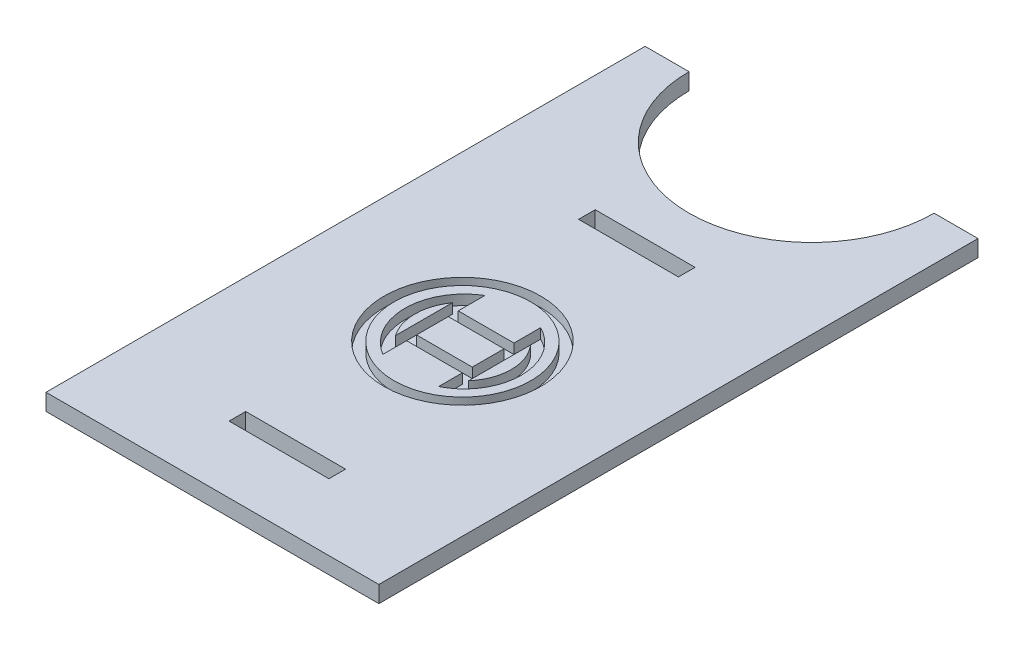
from build123d import *

# Parameters (mm, degrees)
CROQUIS1_W              = 30
CROQUIS1_H              = 5
SALIENTE_EXTRUIR1_DEPTH = 5
CROQUIS2_R              = 23.543607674
CROQUIS2_R_2            = 20.543607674
CROQUIS2_W              = 16.742020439
CROQUIS2_H              = 9.524349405
CORTAR_EXTRUIR2_DEPTH   = 3


with BuildPart() as part:
    # Croquis1 → Saliente-Extruir1 (new body)
    with BuildSketch(Plane(origin=(0, 0, 0), x_dir=(1, 0, 0), z_dir=(0, 1, 0))):
        with BuildLine():
            Line((372.331952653, 49.093638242), (385.516384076, 49.093638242))
            Line((385.516384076, 49.093638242), (385.516384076, -130.906361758))
            Line((385.516384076, -130.906361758), (285.516384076, -130.906361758))
            Line((285.516384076, -130.906361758), (285.516384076, 49.093638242))
            Line((285.516384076, 49.093638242), (298.700815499, 49.093638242))
            ThreePointArc((298.700815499, 49.093638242), (335.516384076, 12.278069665), (372.331952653, 49.093638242))
        make_face()
        with Locations((335.516384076, -108.406361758)):
            Rectangle(CROQUIS1_W, CROQUIS1_H, mode=Mode.SUBTRACT)
        with Locations((335.516384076, -3.406361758)):
            Rectangle(CROQUIS1_W, CROQUIS1_H, mode=Mode.SUBTRACT)
    extrude(amount=SALIENTE_EXTRUIR1_DEPTH)

    # Croquis2 → Cortar-Extruir2 (cut)
    # profile 1 of 2: a face of its own
    with BuildSketch(Plane(origin=(0, 5, 0), x_dir=(1, 0, 0), z_dir=(0, 1, 0))):
        with Locations(Location((334.807914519, -55.096191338, 0), (0, 0, 270))):
            Circle(CROQUIS2_R)
        with Locations(Location((334.807914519, -55.096191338, 0), (0, 0, 270))):
            Circle(CROQUIS2_R_2, mode=Mode.SUBTRACT)
    # profile 2 of 2: a face of its own
    with BuildSketch(Plane(origin=(0, 5, 0), x_dir=(1, 0, 0), z_dir=(0, 1, 0))):
        with BuildLine():
            ThreePointArc((343.002887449, -39.7884707), (352.494266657, -55.116720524), (343.002887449, -70.444970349))
            Line((343.002887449, -70.444970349), (343.002887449, -63.325349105))
            Line((343.002887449, -63.325349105), (326.26086701, -63.325349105))
            Line((326.26086701, -63.325349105), (326.26086701, -70.444970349))
            ThreePointArc((326.26086701, -70.444970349), (317.560442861, -55.116720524), (326.26086701, -39.7884707))
            Line((326.26086701, -39.7884707), (326.26086701, -47.8009997))
            Line((326.26086701, -47.8009997), (343.002887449, -47.8009997))
            Line((343.002887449, -47.8009997), (343.002887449, -39.7884707))
        make_face()
        with BuildLine():
            ThreePointArc((323.26086701, -46.577104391), (320.560442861, -55.116720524), (323.26086701, -63.656336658))
            Line((323.26086701, -63.656336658), (323.26086701, -46.577104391))
        make_face(mode=Mode.SUBTRACT)
        with Locations((334.631877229, -55.563174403)):
            Rectangle(CROQUIS2_W, CROQUIS2_H, mode=Mode.SUBTRACT)
        with BuildLine():
            Line((346.002887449, -64.413369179), (346.002887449, -45.82007187))
            ThreePointArc((346.002887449, -45.82007187), (349.494266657, -55.116720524), (346.002887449, -64.413369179))
        make_face(mode=Mode.SUBTRACT)
    extrude(amount=-CORTAR_EXTRUIR2_DEPTH, mode=Mode.SUBTRACT)


solid = part.part
